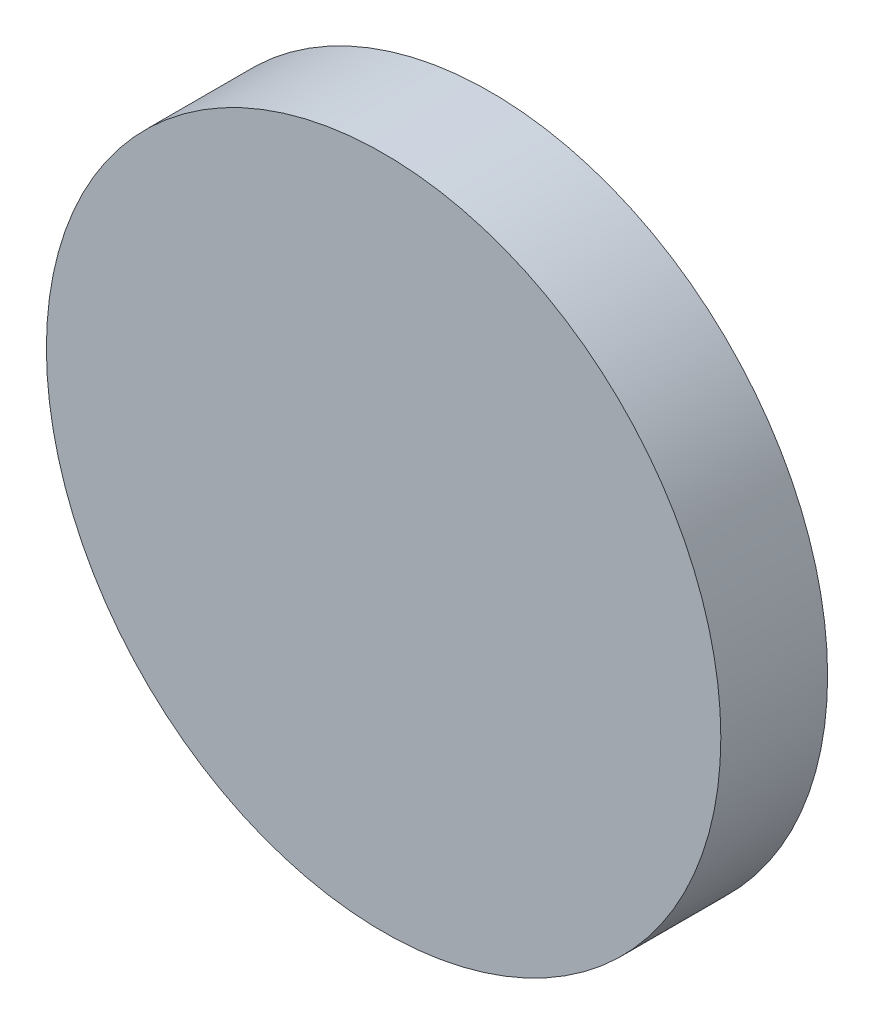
ISO-10303-21;
HEADER;
FILE_DESCRIPTION(('STEP AP214'),'2;1');
FILE_NAME('part.step','',(''),(''),'','','');
FILE_SCHEMA(('AUTOMOTIVE_DESIGN { 1 0 10303 214 1 1 1 1 }'));
ENDSEC;
DATA;
#1=APPLICATION_CONTEXT('core data for automotive mechanical design processes');
#2=APPLICATION_PROTOCOL_DEFINITION('international standard','automotive_design',2000,#1);
#3=PRODUCT_CONTEXT('',#1,'mechanical');
#4=PRODUCT('Part','Part','',(#3));
#5=PRODUCT_RELATED_PRODUCT_CATEGORY('part','',(#4));
#6=PRODUCT_DEFINITION_FORMATION('','',#4);
#7=PRODUCT_DEFINITION_CONTEXT('part definition',#1,'design');
#8=PRODUCT_DEFINITION('design','',#6,#7);
#9=PRODUCT_DEFINITION_SHAPE('','',#8);
#10=(LENGTH_UNIT() NAMED_UNIT(*) SI_UNIT(.MILLI.,.METRE.));
#11=(NAMED_UNIT(*) PLANE_ANGLE_UNIT() SI_UNIT($,.RADIAN.));
#12=(NAMED_UNIT(*) SI_UNIT($,.STERADIAN.) SOLID_ANGLE_UNIT());
#13=UNCERTAINTY_MEASURE_WITH_UNIT(LENGTH_MEASURE(1.E-05),#10,'distance_accuracy_value','');
#14=(GEOMETRIC_REPRESENTATION_CONTEXT(3) GLOBAL_UNCERTAINTY_ASSIGNED_CONTEXT((#13)) GLOBAL_UNIT_ASSIGNED_CONTEXT((#10,
#11,#12)) REPRESENTATION_CONTEXT('',''));
#15=CARTESIAN_POINT('',(0.,0.,0.));
#16=DIRECTION('',(0.,0.,1.));
#17=DIRECTION('',(1.,0.,0.));
#18=AXIS2_PLACEMENT_3D('',#15,#16,#17);
#19=CARTESIAN_POINT('',(0.3,0.,0.095));
#20=DIRECTION('',(0.,0.,-1.));
#21=DIRECTION('',(-1.,0.,0.));
#22=AXIS2_PLACEMENT_3D('',#19,#20,#21);
#23=PLANE('',#22);
#24=CARTESIAN_POINT('',(0.,0.,0.095));
#25=DIRECTION('',(0.,0.,-1.));
#26=DIRECTION('',(-1.,0.,0.));
#27=AXIS2_PLACEMENT_3D('',#24,#25,#26);
#28=CIRCLE('',#27,0.3);
#29=CARTESIAN_POINT('',(-0.3,0.,0.095));
#30=VERTEX_POINT('',#29);
#31=EDGE_CURVE('E18',#30,#30,#28,.T.);
#32=ORIENTED_EDGE('',*,*,#31,.F.);
#33=EDGE_LOOP('',(#32));
#34=FACE_BOUND('',#33,.T.);
#35=ADVANCED_FACE('F15',(#34),#23,.F.);
#36=CARTESIAN_POINT('',(0.,0.,0.));
#37=DIRECTION('',(0.,0.,-1.));
#38=DIRECTION('',(-1.,0.,0.));
#39=AXIS2_PLACEMENT_3D('',#36,#37,#38);
#40=CYLINDRICAL_SURFACE('',#39,0.3);
#41=CARTESIAN_POINT('',(0.,0.,0.));
#42=DIRECTION('',(0.,0.,-1.));
#43=DIRECTION('',(-1.,0.,0.));
#44=AXIS2_PLACEMENT_3D('',#41,#42,#43);
#45=CIRCLE('',#44,0.3);
#46=CARTESIAN_POINT('',(-0.3,0.,0.));
#47=VERTEX_POINT('',#46);
#48=EDGE_CURVE('E10',#47,#47,#45,.T.);
#49=ORIENTED_EDGE('',*,*,#48,.F.);
#50=EDGE_LOOP('',(#49));
#51=FACE_BOUND('',#50,.T.);
#52=ORIENTED_EDGE('',*,*,#31,.T.);
#53=EDGE_LOOP('',(#52));
#54=FACE_BOUND('',#53,.T.);
#55=ADVANCED_FACE('F27',(#51,#54),#40,.T.);
#56=CARTESIAN_POINT('',(0.3,0.,0.));
#57=DIRECTION('',(0.,0.,-1.));
#58=DIRECTION('',(-1.,0.,0.));
#59=AXIS2_PLACEMENT_3D('',#56,#57,#58);
#60=PLANE('',#59);
#61=ORIENTED_EDGE('',*,*,#48,.T.);
#62=EDGE_LOOP('',(#61));
#63=FACE_BOUND('',#62,.T.);
#64=ADVANCED_FACE('F34',(#63),#60,.T.);
#65=CLOSED_SHELL('',(#35,#55,#64));
#66=MANIFOLD_SOLID_BREP('B1',#65);
#67=ADVANCED_BREP_SHAPE_REPRESENTATION('',(#18,#66),#14);
#68=SHAPE_DEFINITION_REPRESENTATION(#9,#67);
ENDSEC;
END-ISO-10303-21;
